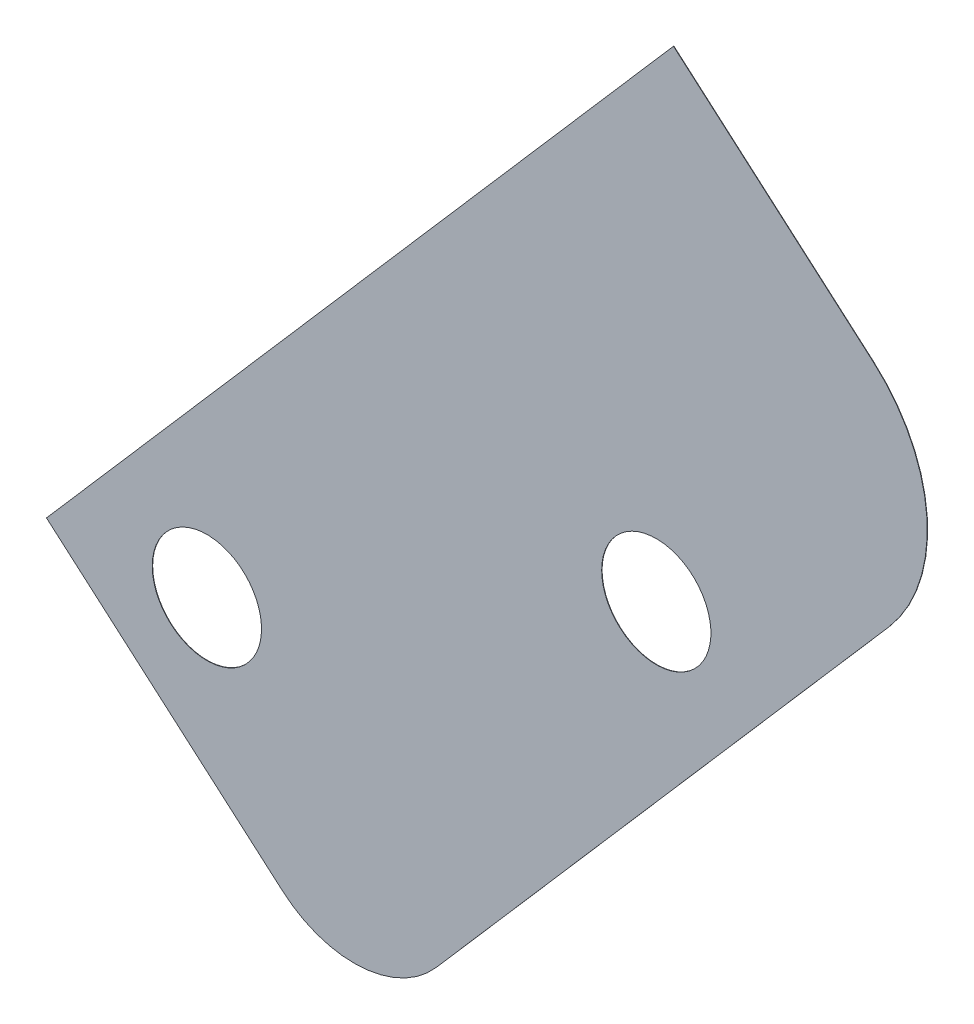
from build123d import *

# Parameters (mm, degrees)
BOSS_EXTRUDE1_DEPTH = 0.0254
HOLE1_D             = 7.1374


with BuildPart() as part:
    # Sketch1 → Boss-Extrude1 (new body)
    with BuildSketch(Plane.XY):
        with BuildLine():
            Line((-650.49041984, -114.99726321), (-620.92863033, -80.956731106))
            ThreePointArc((-620.92863033, -80.956731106), (-618.434035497, -73.489047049), (-621.950540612, -66.44465209))
            Line((-621.950540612, -66.44465209), (-634.991420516, -55.119572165))
            Line((-634.991420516, -55.119572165), (-675.961562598, -102.296872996))
            Line((-675.961562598, -102.296872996), (-660.523462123, -115.703769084))
            ThreePointArc((-660.523462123, -115.703769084), (-655.360618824, -117.42842724), (-650.49041984, -114.99726321))
        make_face()
    extrude(amount=BOSS_EXTRUDE1_DEPTH)

    # Hole1 (through all)
    with Locations(Plane(origin=(-661.826355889, -90.957686, 0), x_dir=(-1, 0, 0), z_dir=(0, 0, -1))):
        with Locations((3.654260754, -10.601140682), (-25.711875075, 3.845190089)):
            Hole(HOLE1_D / 2)


solid = part.part
